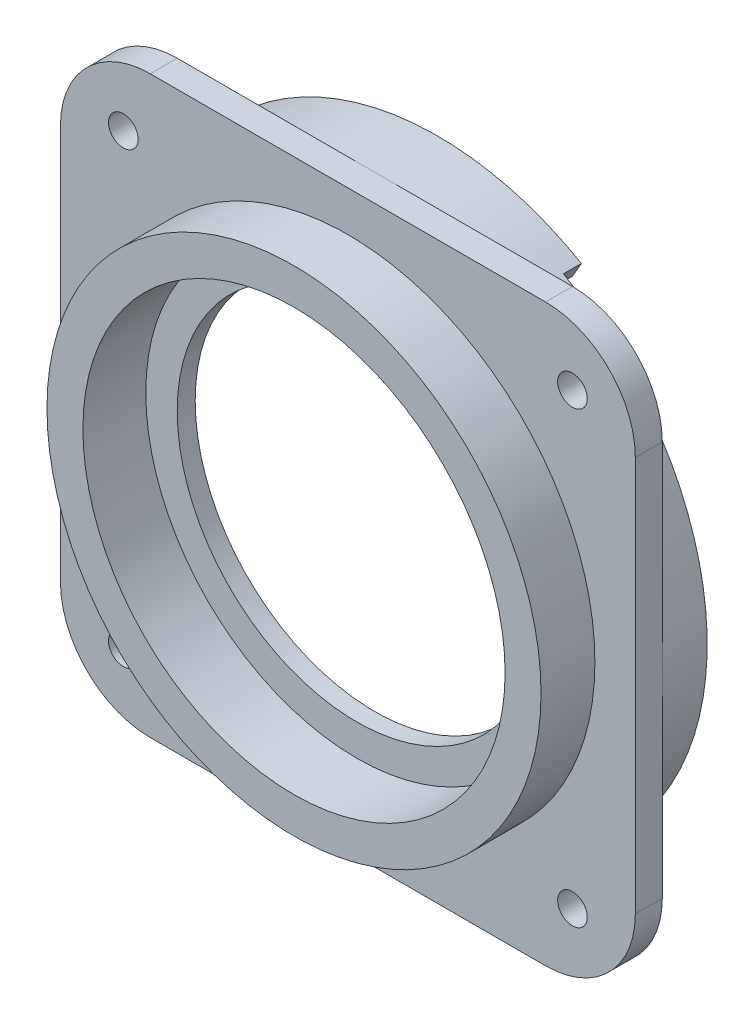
ISO-10303-21;
HEADER;
FILE_DESCRIPTION(('STEP AP214'),'2;1');
FILE_NAME('part.step','',(''),(''),'','','');
FILE_SCHEMA(('AUTOMOTIVE_DESIGN { 1 0 10303 214 1 1 1 1 }'));
ENDSEC;
DATA;
#1=APPLICATION_CONTEXT('core data for automotive mechanical design processes');
#2=APPLICATION_PROTOCOL_DEFINITION('international standard','automotive_design',2000,#1);
#3=PRODUCT_CONTEXT('',#1,'mechanical');
#4=PRODUCT('Part','Part','',(#3));
#5=PRODUCT_RELATED_PRODUCT_CATEGORY('part','',(#4));
#6=PRODUCT_DEFINITION_FORMATION('','',#4);
#7=PRODUCT_DEFINITION_CONTEXT('part definition',#1,'design');
#8=PRODUCT_DEFINITION('design','',#6,#7);
#9=PRODUCT_DEFINITION_SHAPE('','',#8);
#10=(LENGTH_UNIT() NAMED_UNIT(*) SI_UNIT(.MILLI.,.METRE.));
#11=(NAMED_UNIT(*) PLANE_ANGLE_UNIT() SI_UNIT($,.RADIAN.));
#12=(NAMED_UNIT(*) SI_UNIT($,.STERADIAN.) SOLID_ANGLE_UNIT());
#13=UNCERTAINTY_MEASURE_WITH_UNIT(LENGTH_MEASURE(1.E-05),#10,'distance_accuracy_value','');
#14=(GEOMETRIC_REPRESENTATION_CONTEXT(3) GLOBAL_UNCERTAINTY_ASSIGNED_CONTEXT((#13)) GLOBAL_UNIT_ASSIGNED_CONTEXT((#10,
#11,#12)) REPRESENTATION_CONTEXT('',''));
#15=CARTESIAN_POINT('',(0.,0.,0.));
#16=DIRECTION('',(0.,0.,1.));
#17=DIRECTION('',(1.,0.,0.));
#18=AXIS2_PLACEMENT_3D('',#15,#16,#17);
#19=CARTESIAN_POINT('',(0.,0.,10.));
#20=DIRECTION('',(0.,0.,1.));
#21=DIRECTION('',(1.,0.,0.));
#22=AXIS2_PLACEMENT_3D('',#19,#20,#21);
#23=PLANE('',#22);
#24=CARTESIAN_POINT('',(0.,0.,10.));
#25=DIRECTION('',(0.,0.,1.));
#26=DIRECTION('',(1.,0.,0.));
#27=AXIS2_PLACEMENT_3D('',#24,#25,#26);
#28=CIRCLE('',#27,23.5);
#29=CARTESIAN_POINT('',(23.5,0.,10.));
#30=VERTEX_POINT('',#29);
#31=EDGE_CURVE('E205',#30,#30,#28,.T.);
#32=ORIENTED_EDGE('',*,*,#31,.F.);
#33=EDGE_LOOP('',(#32));
#34=FACE_BOUND('',#33,.T.);
#35=CARTESIAN_POINT('',(0.,0.,10.));
#36=DIRECTION('',(0.,0.,1.));
#37=DIRECTION('',(1.,0.,0.));
#38=AXIS2_PLACEMENT_3D('',#35,#36,#37);
#39=CIRCLE('',#38,27.5);
#40=CARTESIAN_POINT('',(27.5,0.,10.));
#41=VERTEX_POINT('',#40);
#42=EDGE_CURVE('E448',#41,#41,#39,.T.);
#43=ORIENTED_EDGE('',*,*,#42,.T.);
#44=EDGE_LOOP('',(#43));
#45=FACE_BOUND('',#44,.T.);
#46=ADVANCED_FACE('F74',(#34,#45),#23,.T.);
#47=CARTESIAN_POINT('',(0.,0.,4.));
#48=DIRECTION('',(0.,0.,1.));
#49=DIRECTION('',(1.,0.,0.));
#50=AXIS2_PLACEMENT_3D('',#47,#48,#49);
#51=CYLINDRICAL_SURFACE('',#50,20.);
#52=CARTESIAN_POINT('',(0.,0.,1.));
#53=DIRECTION('',(0.,0.,-1.));
#54=DIRECTION('',(-1.,0.,0.));
#55=AXIS2_PLACEMENT_3D('',#52,#53,#54);
#56=CIRCLE('',#55,20.);
#57=CARTESIAN_POINT('',(-20.,0.,1.));
#58=VERTEX_POINT('',#57);
#59=EDGE_CURVE('E212',#58,#58,#56,.T.);
#60=ORIENTED_EDGE('',*,*,#59,.T.);
#61=EDGE_LOOP('',(#60));
#62=FACE_BOUND('',#61,.T.);
#63=CARTESIAN_POINT('',(0.,0.,3.));
#64=DIRECTION('',(0.,0.,1.));
#65=DIRECTION('',(1.,0.,0.));
#66=AXIS2_PLACEMENT_3D('',#63,#64,#65);
#67=CIRCLE('',#66,20.);
#68=CARTESIAN_POINT('',(20.,0.,3.));
#69=VERTEX_POINT('',#68);
#70=EDGE_CURVE('E78',#69,#69,#67,.F.);
#71=ORIENTED_EDGE('',*,*,#70,.F.);
#72=EDGE_LOOP('',(#71));
#73=FACE_BOUND('',#72,.T.);
#74=ADVANCED_FACE('F381',(#62,#73),#51,.F.);
#75=CARTESIAN_POINT('',(0.,0.,6.));
#76=DIRECTION('',(0.,0.,-1.));
#77=DIRECTION('',(-1.,0.,0.));
#78=AXIS2_PLACEMENT_3D('',#75,#76,#77);
#79=CYLINDRICAL_SURFACE('',#78,32.);
#80=CARTESIAN_POINT('',(0.,0.,-6.));
#81=DIRECTION('',(0.,0.,1.));
#82=DIRECTION('',(1.,0.,0.));
#83=AXIS2_PLACEMENT_3D('',#80,#81,#82);
#84=CIRCLE('',#83,32.);
#85=CARTESIAN_POINT('',(16.0000000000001,27.712812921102,-6.));
#86=VERTEX_POINT('',#85);
#87=CARTESIAN_POINT('',(16.0000000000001,-27.712812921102,-6.));
#88=VERTEX_POINT('',#87);
#89=EDGE_CURVE('E273',#86,#88,#84,.T.);
#90=ORIENTED_EDGE('',*,*,#89,.T.);
#91=DIRECTION('',(0.,0.,-1.));
#92=VECTOR('',#91,1.);
#93=CARTESIAN_POINT('',(16.0000000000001,-27.712812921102,-4.));
#94=LINE('',#93,#92);
#95=CARTESIAN_POINT('',(16.0000000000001,-27.712812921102,-4.));
#96=VERTEX_POINT('',#95);
#97=EDGE_CURVE('E200',#96,#88,#94,.T.);
#98=ORIENTED_EDGE('',*,*,#97,.F.);
#99=CARTESIAN_POINT('',(0.,0.,-4.));
#100=DIRECTION('',(0.,0.,-1.));
#101=DIRECTION('',(-1.,0.,0.));
#102=AXIS2_PLACEMENT_3D('',#99,#100,#101);
#103=CIRCLE('',#102,32.);
#104=CARTESIAN_POINT('',(16.0000000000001,27.712812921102,-4.));
#105=VERTEX_POINT('',#104);
#106=EDGE_CURVE('E182',#105,#96,#103,.T.);
#107=ORIENTED_EDGE('',*,*,#106,.F.);
#108=DIRECTION('',(0.,0.,-1.));
#109=VECTOR('',#108,1.);
#110=CARTESIAN_POINT('',(16.0000000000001,27.712812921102,-4.));
#111=LINE('',#110,#109);
#112=EDGE_CURVE('E179',#105,#86,#111,.T.);
#113=ORIENTED_EDGE('',*,*,#112,.T.);
#114=EDGE_LOOP('',(#90,#98,#107,#113));
#115=FACE_BOUND('',#114,.T.);
#116=CARTESIAN_POINT('',(0.,0.,1.));
#117=DIRECTION('',(0.,0.,-1.));
#118=DIRECTION('',(-1.,0.,0.));
#119=AXIS2_PLACEMENT_3D('',#116,#117,#118);
#120=CIRCLE('',#119,32.);
#121=CARTESIAN_POINT('',(32.,0.,1.));
#122=VERTEX_POINT('',#121);
#123=CARTESIAN_POINT('',(0.,-32.,1.));
#124=VERTEX_POINT('',#123);
#125=EDGE_CURVE('E269',#122,#124,#120,.T.);
#126=ORIENTED_EDGE('',*,*,#125,.T.);
#127=CARTESIAN_POINT('',(0.,0.,1.));
#128=DIRECTION('',(0.,0.,-1.));
#129=DIRECTION('',(-1.,0.,0.));
#130=AXIS2_PLACEMENT_3D('',#127,#128,#129);
#131=CIRCLE('',#130,32.);
#132=CARTESIAN_POINT('',(-32.,0.,1.));
#133=VERTEX_POINT('',#132);
#134=EDGE_CURVE('E233',#124,#133,#131,.T.);
#135=ORIENTED_EDGE('',*,*,#134,.T.);
#136=CARTESIAN_POINT('',(0.,0.,1.));
#137=DIRECTION('',(0.,0.,-1.));
#138=DIRECTION('',(-1.,0.,0.));
#139=AXIS2_PLACEMENT_3D('',#136,#137,#138);
#140=CIRCLE('',#139,32.);
#141=CARTESIAN_POINT('',(0.,32.,1.));
#142=VERTEX_POINT('',#141);
#143=EDGE_CURVE('E239',#133,#142,#140,.T.);
#144=ORIENTED_EDGE('',*,*,#143,.T.);
#145=CARTESIAN_POINT('',(0.,0.,1.));
#146=DIRECTION('',(0.,0.,-1.));
#147=DIRECTION('',(-1.,0.,0.));
#148=AXIS2_PLACEMENT_3D('',#145,#146,#147);
#149=CIRCLE('',#148,32.);
#150=EDGE_CURVE('E255',#142,#122,#149,.T.);
#151=ORIENTED_EDGE('',*,*,#150,.T.);
#152=EDGE_LOOP('',(#126,#135,#144,#151));
#153=FACE_BOUND('',#152,.T.);
#154=ADVANCED_FACE('F346',(#115,#153),#79,.T.);
#155=CARTESIAN_POINT('',(0.,0.,6.));
#156=DIRECTION('',(0.,0.,-1.));
#157=DIRECTION('',(-1.,0.,0.));
#158=AXIS2_PLACEMENT_3D('',#155,#156,#157);
#159=CYLINDRICAL_SURFACE('',#158,30.);
#160=DIRECTION('',(0.,0.,-1.));
#161=VECTOR('',#160,1.);
#162=CARTESIAN_POINT('',(15.0000000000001,-25.9807621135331,-4.));
#163=LINE('',#162,#161);
#164=CARTESIAN_POINT('',(15.0000000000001,-25.9807621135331,-4.));
#165=VERTEX_POINT('',#164);
#166=CARTESIAN_POINT('',(15.0000000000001,-25.9807621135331,-6.));
#167=VERTEX_POINT('',#166);
#168=EDGE_CURVE('E209',#165,#167,#163,.T.);
#169=ORIENTED_EDGE('',*,*,#168,.T.);
#170=CARTESIAN_POINT('',(0.,0.,-6.));
#171=DIRECTION('',(0.,0.,1.));
#172=DIRECTION('',(1.,0.,0.));
#173=AXIS2_PLACEMENT_3D('',#170,#171,#172);
#174=CIRCLE('',#173,30.);
#175=CARTESIAN_POINT('',(15.0000000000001,25.9807621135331,-6.));
#176=VERTEX_POINT('',#175);
#177=EDGE_CURVE('E198',#176,#167,#174,.T.);
#178=ORIENTED_EDGE('',*,*,#177,.F.);
#179=DIRECTION('',(0.,0.,-1.));
#180=VECTOR('',#179,1.);
#181=CARTESIAN_POINT('',(15.0000000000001,25.9807621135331,-4.));
#182=LINE('',#181,#180);
#183=CARTESIAN_POINT('',(15.0000000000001,25.9807621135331,-4.));
#184=VERTEX_POINT('',#183);
#185=EDGE_CURVE('E90',#184,#176,#182,.T.);
#186=ORIENTED_EDGE('',*,*,#185,.F.);
#187=CARTESIAN_POINT('',(0.,0.,-4.));
#188=DIRECTION('',(0.,0.,1.));
#189=DIRECTION('',(-1.,0.,0.));
#190=AXIS2_PLACEMENT_3D('',#187,#188,#189);
#191=CIRCLE('',#190,30.);
#192=EDGE_CURVE('E183',#165,#184,#191,.T.);
#193=ORIENTED_EDGE('',*,*,#192,.F.);
#194=EDGE_LOOP('',(#169,#178,#186,#193));
#195=FACE_BOUND('',#194,.T.);
#196=CARTESIAN_POINT('',(0.,0.,1.));
#197=DIRECTION('',(0.,0.,-1.));
#198=DIRECTION('',(-1.,0.,0.));
#199=AXIS2_PLACEMENT_3D('',#196,#197,#198);
#200=CIRCLE('',#199,30.);
#201=CARTESIAN_POINT('',(-30.,0.,1.));
#202=VERTEX_POINT('',#201);
#203=EDGE_CURVE('E12',#202,#202,#200,.T.);
#204=ORIENTED_EDGE('',*,*,#203,.F.);
#205=EDGE_LOOP('',(#204));
#206=FACE_BOUND('',#205,.T.);
#207=ADVANCED_FACE('F195',(#195,#206),#159,.F.);
#208=CARTESIAN_POINT('',(0.,0.,-6.));
#209=DIRECTION('',(0.,0.,1.));
#210=DIRECTION('',(1.,0.,0.));
#211=AXIS2_PLACEMENT_3D('',#208,#209,#210);
#212=PLANE('',#211);
#213=ORIENTED_EDGE('',*,*,#177,.T.);
#214=DIRECTION('',(-0.500000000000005,0.866025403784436,0.));
#215=VECTOR('',#214,1.);
#216=CARTESIAN_POINT('',(16.0000000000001,-27.712812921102,-6.));
#217=LINE('',#216,#215);
#218=EDGE_CURVE('E192',#88,#167,#217,.T.);
#219=ORIENTED_EDGE('',*,*,#218,.F.);
#220=ORIENTED_EDGE('',*,*,#89,.F.);
#221=DIRECTION('',(0.500000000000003,0.866025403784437,0.));
#222=VECTOR('',#221,1.);
#223=CARTESIAN_POINT('',(16.0000000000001,27.712812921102,-6.));
#224=LINE('',#223,#222);
#225=EDGE_CURVE('E447',#176,#86,#224,.T.);
#226=ORIENTED_EDGE('',*,*,#225,.F.);
#227=EDGE_LOOP('',(#213,#219,#220,#226));
#228=FACE_BOUND('',#227,.T.);
#229=ADVANCED_FACE('F462',(#228),#212,.F.);
#230=CARTESIAN_POINT('',(32.,0.,4.));
#231=DIRECTION('',(-1.,0.,0.));
#232=DIRECTION('',(0.,0.,1.));
#233=AXIS2_PLACEMENT_3D('',#230,#231,#232);
#234=PLANE('',#233);
#235=DIRECTION('',(0.,1.,0.));
#236=VECTOR('',#235,1.);
#237=CARTESIAN_POINT('',(32.,0.,4.));
#238=LINE('',#237,#236);
#239=CARTESIAN_POINT('',(32.,-22.,4.));
#240=VERTEX_POINT('',#239);
#241=CARTESIAN_POINT('',(32.,22.,4.));
#242=VERTEX_POINT('',#241);
#243=EDGE_CURVE('E261',#240,#242,#238,.T.);
#244=ORIENTED_EDGE('',*,*,#243,.F.);
#245=DIRECTION('',(0.,0.,-1.));
#246=VECTOR('',#245,1.);
#247=CARTESIAN_POINT('',(32.,-22.,1.));
#248=LINE('',#247,#246);
#249=CARTESIAN_POINT('',(32.,-22.,1.));
#250=VERTEX_POINT('',#249);
#251=EDGE_CURVE('E303',#240,#250,#248,.T.);
#252=ORIENTED_EDGE('',*,*,#251,.T.);
#253=DIRECTION('',(0.,1.,0.));
#254=VECTOR('',#253,1.);
#255=CARTESIAN_POINT('',(32.,0.,1.));
#256=LINE('',#255,#254);
#257=EDGE_CURVE('E265',#250,#122,#256,.T.);
#258=ORIENTED_EDGE('',*,*,#257,.T.);
#259=DIRECTION('',(0.,1.,0.));
#260=VECTOR('',#259,1.);
#261=CARTESIAN_POINT('',(32.,0.,1.));
#262=LINE('',#261,#260);
#263=CARTESIAN_POINT('',(32.,22.,1.));
#264=VERTEX_POINT('',#263);
#265=EDGE_CURVE('E258',#122,#264,#262,.T.);
#266=ORIENTED_EDGE('',*,*,#265,.T.);
#267=DIRECTION('',(0.,0.,-1.));
#268=VECTOR('',#267,1.);
#269=CARTESIAN_POINT('',(32.,22.,4.));
#270=LINE('',#269,#268);
#271=EDGE_CURVE('E301',#264,#242,#270,.F.);
#272=ORIENTED_EDGE('',*,*,#271,.T.);
#273=EDGE_LOOP('',(#244,#252,#258,#266,#272));
#274=FACE_BOUND('',#273,.T.);
#275=ADVANCED_FACE('F365',(#274),#234,.F.);
#276=CARTESIAN_POINT('',(0.,-32.,4.));
#277=DIRECTION('',(0.,-1.,0.));
#278=DIRECTION('',(0.,0.,-1.));
#279=AXIS2_PLACEMENT_3D('',#276,#277,#278);
#280=PLANE('',#279);
#281=DIRECTION('',(-1.,0.,0.));
#282=VECTOR('',#281,1.);
#283=CARTESIAN_POINT('',(0.,-32.,4.));
#284=LINE('',#283,#282);
#285=CARTESIAN_POINT('',(22.,-32.,4.));
#286=VERTEX_POINT('',#285);
#287=CARTESIAN_POINT('',(-22.,-32.,4.));
#288=VERTEX_POINT('',#287);
#289=EDGE_CURVE('E230',#286,#288,#284,.T.);
#290=ORIENTED_EDGE('',*,*,#289,.T.);
#291=DIRECTION('',(0.,0.,-1.));
#292=VECTOR('',#291,1.);
#293=CARTESIAN_POINT('',(-22.,-32.,4.));
#294=LINE('',#293,#292);
#295=CARTESIAN_POINT('',(-22.,-32.,1.));
#296=VERTEX_POINT('',#295);
#297=EDGE_CURVE('E288',#288,#296,#294,.T.);
#298=ORIENTED_EDGE('',*,*,#297,.T.);
#299=DIRECTION('',(-1.,0.,0.));
#300=VECTOR('',#299,1.);
#301=CARTESIAN_POINT('',(0.,-32.,1.));
#302=LINE('',#301,#300);
#303=EDGE_CURVE('E234',#124,#296,#302,.T.);
#304=ORIENTED_EDGE('',*,*,#303,.F.);
#305=DIRECTION('',(-1.,0.,0.));
#306=VECTOR('',#305,1.);
#307=CARTESIAN_POINT('',(0.,-32.,1.));
#308=LINE('',#307,#306);
#309=CARTESIAN_POINT('',(22.,-32.,1.));
#310=VERTEX_POINT('',#309);
#311=EDGE_CURVE('E267',#310,#124,#308,.T.);
#312=ORIENTED_EDGE('',*,*,#311,.F.);
#313=DIRECTION('',(0.,0.,-1.));
#314=VECTOR('',#313,1.);
#315=CARTESIAN_POINT('',(22.,-32.,4.));
#316=LINE('',#315,#314);
#317=EDGE_CURVE('E276',#310,#286,#316,.F.);
#318=ORIENTED_EDGE('',*,*,#317,.T.);
#319=EDGE_LOOP('',(#290,#298,#304,#312,#318));
#320=FACE_BOUND('',#319,.T.);
#321=ADVANCED_FACE('F354',(#320),#280,.T.);
#322=CARTESIAN_POINT('',(0.,0.,4.));
#323=DIRECTION('',(0.,0.,-1.));
#324=DIRECTION('',(-1.,0.,0.));
#325=AXIS2_PLACEMENT_3D('',#322,#323,#324);
#326=PLANE('',#325);
#327=CARTESIAN_POINT('',(25.,-25.,4.));
#328=DIRECTION('',(0.,0.,1.));
#329=DIRECTION('',(1.,0.,0.));
#330=AXIS2_PLACEMENT_3D('',#327,#328,#329);
#331=CIRCLE('',#330,1.65);
#332=CARTESIAN_POINT('',(26.65,-25.,4.));
#333=VERTEX_POINT('',#332);
#334=EDGE_CURVE('E220',#333,#333,#331,.T.);
#335=ORIENTED_EDGE('',*,*,#334,.F.);
#336=EDGE_LOOP('',(#335));
#337=FACE_BOUND('',#336,.T.);
#338=ORIENTED_EDGE('',*,*,#289,.F.);
#339=CARTESIAN_POINT('',(22.,-22.,4.));
#340=DIRECTION('',(0.,0.,-1.));
#341=DIRECTION('',(-1.,0.,0.));
#342=AXIS2_PLACEMENT_3D('',#339,#340,#341);
#343=CIRCLE('',#342,10.);
#344=EDGE_CURVE('E308',#286,#240,#343,.F.);
#345=ORIENTED_EDGE('',*,*,#344,.T.);
#346=ORIENTED_EDGE('',*,*,#243,.T.);
#347=CARTESIAN_POINT('',(22.,22.,4.));
#348=DIRECTION('',(0.,0.,-1.));
#349=DIRECTION('',(-1.,0.,0.));
#350=AXIS2_PLACEMENT_3D('',#347,#348,#349);
#351=CIRCLE('',#350,10.);
#352=CARTESIAN_POINT('',(22.,32.,4.));
#353=VERTEX_POINT('',#352);
#354=EDGE_CURVE('E317',#242,#353,#351,.F.);
#355=ORIENTED_EDGE('',*,*,#354,.T.);
#356=DIRECTION('',(-1.,0.,0.));
#357=VECTOR('',#356,1.);
#358=CARTESIAN_POINT('',(0.,32.,4.));
#359=LINE('',#358,#357);
#360=CARTESIAN_POINT('',(-22.,32.,4.));
#361=VERTEX_POINT('',#360);
#362=EDGE_CURVE('E98',#353,#361,#359,.T.);
#363=ORIENTED_EDGE('',*,*,#362,.T.);
#364=CARTESIAN_POINT('',(-22.,22.,4.));
#365=DIRECTION('',(0.,0.,-1.));
#366=DIRECTION('',(-1.,0.,0.));
#367=AXIS2_PLACEMENT_3D('',#364,#365,#366);
#368=CIRCLE('',#367,10.);
#369=CARTESIAN_POINT('',(-32.,22.,4.));
#370=VERTEX_POINT('',#369);
#371=EDGE_CURVE('E83',#361,#370,#368,.F.);
#372=ORIENTED_EDGE('',*,*,#371,.T.);
#373=DIRECTION('',(0.,1.,0.));
#374=VECTOR('',#373,1.);
#375=CARTESIAN_POINT('',(-32.,0.,4.));
#376=LINE('',#375,#374);
#377=CARTESIAN_POINT('',(-32.,-22.,4.));
#378=VERTEX_POINT('',#377);
#379=EDGE_CURVE('E245',#378,#370,#376,.T.);
#380=ORIENTED_EDGE('',*,*,#379,.F.);
#381=CARTESIAN_POINT('',(-22.,-22.,4.));
#382=DIRECTION('',(0.,0.,-1.));
#383=DIRECTION('',(-1.,0.,0.));
#384=AXIS2_PLACEMENT_3D('',#381,#382,#383);
#385=CIRCLE('',#384,10.);
#386=EDGE_CURVE('E299',#378,#288,#385,.F.);
#387=ORIENTED_EDGE('',*,*,#386,.T.);
#388=EDGE_LOOP('',(#338,#345,#346,#355,#363,#372,#380,#387));
#389=FACE_BOUND('',#388,.T.);
#390=CARTESIAN_POINT('',(25.,25.,4.));
#391=DIRECTION('',(0.,0.,1.));
#392=DIRECTION('',(1.,0.,0.));
#393=AXIS2_PLACEMENT_3D('',#390,#391,#392);
#394=CIRCLE('',#393,1.65);
#395=CARTESIAN_POINT('',(26.65,25.,4.));
#396=VERTEX_POINT('',#395);
#397=EDGE_CURVE('E216',#396,#396,#394,.T.);
#398=ORIENTED_EDGE('',*,*,#397,.F.);
#399=EDGE_LOOP('',(#398));
#400=FACE_BOUND('',#399,.T.);
#401=CARTESIAN_POINT('',(-25.,25.,4.));
#402=DIRECTION('',(0.,0.,1.));
#403=DIRECTION('',(1.,0.,0.));
#404=AXIS2_PLACEMENT_3D('',#401,#402,#403);
#405=CIRCLE('',#404,1.65);
#406=CARTESIAN_POINT('',(-23.35,25.,4.));
#407=VERTEX_POINT('',#406);
#408=EDGE_CURVE('E225',#407,#407,#405,.T.);
#409=ORIENTED_EDGE('',*,*,#408,.F.);
#410=EDGE_LOOP('',(#409));
#411=FACE_BOUND('',#410,.T.);
#412=CARTESIAN_POINT('',(-25.,-25.,4.));
#413=DIRECTION('',(0.,0.,1.));
#414=DIRECTION('',(1.,0.,0.));
#415=AXIS2_PLACEMENT_3D('',#412,#413,#414);
#416=CIRCLE('',#415,1.65);
#417=CARTESIAN_POINT('',(-23.35,-25.,4.));
#418=VERTEX_POINT('',#417);
#419=EDGE_CURVE('E215',#418,#418,#416,.T.);
#420=ORIENTED_EDGE('',*,*,#419,.F.);
#421=EDGE_LOOP('',(#420));
#422=FACE_BOUND('',#421,.T.);
#423=CARTESIAN_POINT('',(0.,0.,4.));
#424=DIRECTION('',(0.,0.,-1.));
#425=DIRECTION('',(-1.,0.,0.));
#426=AXIS2_PLACEMENT_3D('',#423,#424,#425);
#427=CIRCLE('',#426,27.5);
#428=CARTESIAN_POINT('',(-27.5,0.,4.));
#429=VERTEX_POINT('',#428);
#430=EDGE_CURVE('E445',#429,#429,#427,.F.);
#431=ORIENTED_EDGE('',*,*,#430,.F.);
#432=EDGE_LOOP('',(#431));
#433=FACE_BOUND('',#432,.T.);
#434=ADVANCED_FACE('F323',(#337,#389,#400,#411,#422,#433),#326,.F.);
#435=CARTESIAN_POINT('',(0.,0.,1.));
#436=DIRECTION('',(0.,0.,-1.));
#437=DIRECTION('',(-1.,0.,0.));
#438=AXIS2_PLACEMENT_3D('',#435,#436,#437);
#439=PLANE('',#438);
#440=CARTESIAN_POINT('',(25.,-25.,1.));
#441=DIRECTION('',(0.,0.,-1.));
#442=DIRECTION('',(-1.,0.,0.));
#443=AXIS2_PLACEMENT_3D('',#440,#441,#442);
#444=CIRCLE('',#443,1.65);
#445=CARTESIAN_POINT('',(23.35,-25.,1.));
#446=VERTEX_POINT('',#445);
#447=EDGE_CURVE('E229',#446,#446,#444,.T.);
#448=ORIENTED_EDGE('',*,*,#447,.F.);
#449=EDGE_LOOP('',(#448));
#450=FACE_BOUND('',#449,.T.);
#451=ORIENTED_EDGE('',*,*,#257,.F.);
#452=CARTESIAN_POINT('',(22.,-22.,1.));
#453=DIRECTION('',(0.,0.,-1.));
#454=DIRECTION('',(-1.,0.,0.));
#455=AXIS2_PLACEMENT_3D('',#452,#453,#454);
#456=CIRCLE('',#455,10.);
#457=EDGE_CURVE('E306',#250,#310,#456,.T.);
#458=ORIENTED_EDGE('',*,*,#457,.T.);
#459=ORIENTED_EDGE('',*,*,#311,.T.);
#460=ORIENTED_EDGE('',*,*,#125,.F.);
#461=EDGE_LOOP('',(#451,#458,#459,#460));
#462=FACE_BOUND('',#461,.T.);
#463=ADVANCED_FACE('F367',(#450,#462),#439,.T.);
#464=CARTESIAN_POINT('',(0.,32.,4.));
#465=DIRECTION('',(0.,-1.,0.));
#466=DIRECTION('',(0.,0.,-1.));
#467=AXIS2_PLACEMENT_3D('',#464,#465,#466);
#468=PLANE('',#467);
#469=ORIENTED_EDGE('',*,*,#362,.F.);
#470=DIRECTION('',(0.,0.,-1.));
#471=VECTOR('',#470,1.);
#472=CARTESIAN_POINT('',(22.,32.,4.));
#473=LINE('',#472,#471);
#474=CARTESIAN_POINT('',(22.,32.,1.));
#475=VERTEX_POINT('',#474);
#476=EDGE_CURVE('E313',#353,#475,#473,.T.);
#477=ORIENTED_EDGE('',*,*,#476,.T.);
#478=DIRECTION('',(-1.,0.,0.));
#479=VECTOR('',#478,1.);
#480=CARTESIAN_POINT('',(0.,32.,1.));
#481=LINE('',#480,#479);
#482=EDGE_CURVE('E249',#475,#142,#481,.T.);
#483=ORIENTED_EDGE('',*,*,#482,.T.);
#484=DIRECTION('',(-1.,0.,0.));
#485=VECTOR('',#484,1.);
#486=CARTESIAN_POINT('',(0.,32.,1.));
#487=LINE('',#486,#485);
#488=CARTESIAN_POINT('',(-22.,32.,1.));
#489=VERTEX_POINT('',#488);
#490=EDGE_CURVE('E242',#142,#489,#487,.T.);
#491=ORIENTED_EDGE('',*,*,#490,.T.);
#492=DIRECTION('',(0.,0.,-1.));
#493=VECTOR('',#492,1.);
#494=CARTESIAN_POINT('',(-22.,32.,4.));
#495=LINE('',#494,#493);
#496=EDGE_CURVE('E311',#489,#361,#495,.F.);
#497=ORIENTED_EDGE('',*,*,#496,.T.);
#498=EDGE_LOOP('',(#469,#477,#483,#491,#497));
#499=FACE_BOUND('',#498,.T.);
#500=ADVANCED_FACE('F338',(#499),#468,.F.);
#501=CARTESIAN_POINT('',(0.,0.,1.));
#502=DIRECTION('',(0.,0.,-1.));
#503=DIRECTION('',(-1.,0.,0.));
#504=AXIS2_PLACEMENT_3D('',#501,#502,#503);
#505=PLANE('',#504);
#506=CARTESIAN_POINT('',(25.,25.,1.));
#507=DIRECTION('',(0.,0.,-1.));
#508=DIRECTION('',(-1.,0.,0.));
#509=AXIS2_PLACEMENT_3D('',#506,#507,#508);
#510=CIRCLE('',#509,1.65);
#511=CARTESIAN_POINT('',(23.35,25.,1.));
#512=VERTEX_POINT('',#511);
#513=EDGE_CURVE('E281',#512,#512,#510,.T.);
#514=ORIENTED_EDGE('',*,*,#513,.F.);
#515=EDGE_LOOP('',(#514));
#516=FACE_BOUND('',#515,.T.);
#517=ORIENTED_EDGE('',*,*,#482,.F.);
#518=CARTESIAN_POINT('',(22.,22.,1.));
#519=DIRECTION('',(0.,0.,-1.));
#520=DIRECTION('',(-1.,0.,0.));
#521=AXIS2_PLACEMENT_3D('',#518,#519,#520);
#522=CIRCLE('',#521,10.);
#523=EDGE_CURVE('E315',#475,#264,#522,.T.);
#524=ORIENTED_EDGE('',*,*,#523,.T.);
#525=ORIENTED_EDGE('',*,*,#265,.F.);
#526=ORIENTED_EDGE('',*,*,#150,.F.);
#527=EDGE_LOOP('',(#517,#524,#525,#526));
#528=FACE_BOUND('',#527,.T.);
#529=ADVANCED_FACE('F344',(#516,#528),#505,.T.);
#530=CARTESIAN_POINT('',(-32.,0.,4.));
#531=DIRECTION('',(-1.,0.,0.));
#532=DIRECTION('',(0.,0.,1.));
#533=AXIS2_PLACEMENT_3D('',#530,#531,#532);
#534=PLANE('',#533);
#535=DIRECTION('',(0.,1.,0.));
#536=VECTOR('',#535,1.);
#537=CARTESIAN_POINT('',(-32.,0.,1.));
#538=LINE('',#537,#536);
#539=CARTESIAN_POINT('',(-32.,-22.,1.));
#540=VERTEX_POINT('',#539);
#541=EDGE_CURVE('E237',#540,#133,#538,.T.);
#542=ORIENTED_EDGE('',*,*,#541,.F.);
#543=DIRECTION('',(0.,0.,-1.));
#544=VECTOR('',#543,1.);
#545=CARTESIAN_POINT('',(-32.,-22.,4.));
#546=LINE('',#545,#544);
#547=EDGE_CURVE('E296',#540,#378,#546,.F.);
#548=ORIENTED_EDGE('',*,*,#547,.T.);
#549=ORIENTED_EDGE('',*,*,#379,.T.);
#550=DIRECTION('',(0.,0.,-1.));
#551=VECTOR('',#550,1.);
#552=CARTESIAN_POINT('',(-32.,22.,1.));
#553=LINE('',#552,#551);
#554=CARTESIAN_POINT('',(-32.,22.,1.));
#555=VERTEX_POINT('',#554);
#556=EDGE_CURVE('E293',#370,#555,#553,.T.);
#557=ORIENTED_EDGE('',*,*,#556,.T.);
#558=DIRECTION('',(0.,1.,0.));
#559=VECTOR('',#558,1.);
#560=CARTESIAN_POINT('',(-32.,0.,1.));
#561=LINE('',#560,#559);
#562=EDGE_CURVE('E246',#133,#555,#561,.T.);
#563=ORIENTED_EDGE('',*,*,#562,.F.);
#564=EDGE_LOOP('',(#542,#548,#549,#557,#563));
#565=FACE_BOUND('',#564,.T.);
#566=ADVANCED_FACE('F330',(#565),#534,.T.);
#567=CARTESIAN_POINT('',(0.,0.,1.));
#568=DIRECTION('',(0.,0.,-1.));
#569=DIRECTION('',(-1.,0.,0.));
#570=AXIS2_PLACEMENT_3D('',#567,#568,#569);
#571=PLANE('',#570);
#572=CARTESIAN_POINT('',(-25.,25.,1.));
#573=DIRECTION('',(0.,0.,-1.));
#574=DIRECTION('',(-1.,0.,0.));
#575=AXIS2_PLACEMENT_3D('',#572,#573,#574);
#576=CIRCLE('',#575,1.65);
#577=CARTESIAN_POINT('',(-26.65,25.,1.));
#578=VERTEX_POINT('',#577);
#579=EDGE_CURVE('E228',#578,#578,#576,.T.);
#580=ORIENTED_EDGE('',*,*,#579,.F.);
#581=EDGE_LOOP('',(#580));
#582=FACE_BOUND('',#581,.T.);
#583=ORIENTED_EDGE('',*,*,#562,.T.);
#584=CARTESIAN_POINT('',(-22.,22.,1.));
#585=DIRECTION('',(0.,0.,-1.));
#586=DIRECTION('',(-1.,0.,0.));
#587=AXIS2_PLACEMENT_3D('',#584,#585,#586);
#588=CIRCLE('',#587,10.);
#589=EDGE_CURVE('E319',#555,#489,#588,.T.);
#590=ORIENTED_EDGE('',*,*,#589,.T.);
#591=ORIENTED_EDGE('',*,*,#490,.F.);
#592=ORIENTED_EDGE('',*,*,#143,.F.);
#593=EDGE_LOOP('',(#583,#590,#591,#592));
#594=FACE_BOUND('',#593,.T.);
#595=ADVANCED_FACE('F336',(#582,#594),#571,.T.);
#596=CARTESIAN_POINT('',(0.,0.,1.));
#597=DIRECTION('',(0.,0.,-1.));
#598=DIRECTION('',(-1.,0.,0.));
#599=AXIS2_PLACEMENT_3D('',#596,#597,#598);
#600=PLANE('',#599);
#601=CARTESIAN_POINT('',(-25.,-25.,1.));
#602=DIRECTION('',(0.,0.,-1.));
#603=DIRECTION('',(-1.,0.,0.));
#604=AXIS2_PLACEMENT_3D('',#601,#602,#603);
#605=CIRCLE('',#604,1.65);
#606=CARTESIAN_POINT('',(-26.65,-25.,1.));
#607=VERTEX_POINT('',#606);
#608=EDGE_CURVE('E219',#607,#607,#605,.T.);
#609=ORIENTED_EDGE('',*,*,#608,.F.);
#610=EDGE_LOOP('',(#609));
#611=FACE_BOUND('',#610,.T.);
#612=ORIENTED_EDGE('',*,*,#303,.T.);
#613=CARTESIAN_POINT('',(-22.,-22.,1.));
#614=DIRECTION('',(0.,0.,-1.));
#615=DIRECTION('',(-1.,0.,0.));
#616=AXIS2_PLACEMENT_3D('',#613,#614,#615);
#617=CIRCLE('',#616,10.);
#618=EDGE_CURVE('E291',#296,#540,#617,.T.);
#619=ORIENTED_EDGE('',*,*,#618,.T.);
#620=ORIENTED_EDGE('',*,*,#541,.T.);
#621=ORIENTED_EDGE('',*,*,#134,.F.);
#622=EDGE_LOOP('',(#612,#619,#620,#621));
#623=FACE_BOUND('',#622,.T.);
#624=ADVANCED_FACE('F351',(#611,#623),#600,.T.);
#625=CARTESIAN_POINT('',(-25.,25.,-6.));
#626=DIRECTION('',(0.,0.,1.));
#627=DIRECTION('',(1.,0.,0.));
#628=AXIS2_PLACEMENT_3D('',#625,#626,#627);
#629=CYLINDRICAL_SURFACE('',#628,1.65);
#630=ORIENTED_EDGE('',*,*,#579,.T.);
#631=EDGE_LOOP('',(#630));
#632=FACE_BOUND('',#631,.T.);
#633=ORIENTED_EDGE('',*,*,#408,.T.);
#634=EDGE_LOOP('',(#633));
#635=FACE_BOUND('',#634,.T.);
#636=ADVANCED_FACE('F418',(#632,#635),#629,.F.);
#637=CARTESIAN_POINT('',(-25.,-25.,-6.));
#638=DIRECTION('',(0.,0.,1.));
#639=DIRECTION('',(1.,0.,0.));
#640=AXIS2_PLACEMENT_3D('',#637,#638,#639);
#641=CYLINDRICAL_SURFACE('',#640,1.65);
#642=ORIENTED_EDGE('',*,*,#608,.T.);
#643=EDGE_LOOP('',(#642));
#644=FACE_BOUND('',#643,.T.);
#645=ORIENTED_EDGE('',*,*,#419,.T.);
#646=EDGE_LOOP('',(#645));
#647=FACE_BOUND('',#646,.T.);
#648=ADVANCED_FACE('F411',(#644,#647),#641,.F.);
#649=CARTESIAN_POINT('',(25.,25.,-6.));
#650=DIRECTION('',(0.,0.,1.));
#651=DIRECTION('',(1.,0.,0.));
#652=AXIS2_PLACEMENT_3D('',#649,#650,#651);
#653=CYLINDRICAL_SURFACE('',#652,1.65);
#654=ORIENTED_EDGE('',*,*,#513,.T.);
#655=EDGE_LOOP('',(#654));
#656=FACE_BOUND('',#655,.T.);
#657=ORIENTED_EDGE('',*,*,#397,.T.);
#658=EDGE_LOOP('',(#657));
#659=FACE_BOUND('',#658,.T.);
#660=ADVANCED_FACE('F407',(#656,#659),#653,.F.);
#661=CARTESIAN_POINT('',(25.,-25.,-6.));
#662=DIRECTION('',(0.,0.,1.));
#663=DIRECTION('',(1.,0.,0.));
#664=AXIS2_PLACEMENT_3D('',#661,#662,#663);
#665=CYLINDRICAL_SURFACE('',#664,1.65);
#666=ORIENTED_EDGE('',*,*,#447,.T.);
#667=EDGE_LOOP('',(#666));
#668=FACE_BOUND('',#667,.T.);
#669=ORIENTED_EDGE('',*,*,#334,.T.);
#670=EDGE_LOOP('',(#669));
#671=FACE_BOUND('',#670,.T.);
#672=ADVANCED_FACE('F410',(#668,#671),#665,.F.);
#673=CARTESIAN_POINT('',(-22.,-22.,4.));
#674=DIRECTION('',(0.,0.,-1.));
#675=DIRECTION('',(-1.,0.,0.));
#676=AXIS2_PLACEMENT_3D('',#673,#674,#675);
#677=CYLINDRICAL_SURFACE('',#676,10.);
#678=ORIENTED_EDGE('',*,*,#386,.F.);
#679=ORIENTED_EDGE('',*,*,#547,.F.);
#680=ORIENTED_EDGE('',*,*,#618,.F.);
#681=ORIENTED_EDGE('',*,*,#297,.F.);
#682=EDGE_LOOP('',(#678,#679,#680,#681));
#683=FACE_BOUND('',#682,.T.);
#684=ADVANCED_FACE('F358',(#683),#677,.T.);
#685=CARTESIAN_POINT('',(22.,-22.,4.));
#686=DIRECTION('',(0.,0.,1.));
#687=DIRECTION('',(1.,0.,0.));
#688=AXIS2_PLACEMENT_3D('',#685,#686,#687);
#689=CYLINDRICAL_SURFACE('',#688,10.);
#690=ORIENTED_EDGE('',*,*,#344,.F.);
#691=ORIENTED_EDGE('',*,*,#317,.F.);
#692=ORIENTED_EDGE('',*,*,#457,.F.);
#693=ORIENTED_EDGE('',*,*,#251,.F.);
#694=EDGE_LOOP('',(#690,#691,#692,#693));
#695=FACE_BOUND('',#694,.T.);
#696=ADVANCED_FACE('F362',(#695),#689,.T.);
#697=CARTESIAN_POINT('',(22.,22.,4.));
#698=DIRECTION('',(0.,0.,-1.));
#699=DIRECTION('',(-1.,0.,0.));
#700=AXIS2_PLACEMENT_3D('',#697,#698,#699);
#701=CYLINDRICAL_SURFACE('',#700,10.);
#702=ORIENTED_EDGE('',*,*,#354,.F.);
#703=ORIENTED_EDGE('',*,*,#271,.F.);
#704=ORIENTED_EDGE('',*,*,#523,.F.);
#705=ORIENTED_EDGE('',*,*,#476,.F.);
#706=EDGE_LOOP('',(#702,#703,#704,#705));
#707=FACE_BOUND('',#706,.T.);
#708=ADVANCED_FACE('F474',(#707),#701,.T.);
#709=CARTESIAN_POINT('',(-22.,22.,4.));
#710=DIRECTION('',(0.,0.,1.));
#711=DIRECTION('',(1.,0.,0.));
#712=AXIS2_PLACEMENT_3D('',#709,#710,#711);
#713=CYLINDRICAL_SURFACE('',#712,10.);
#714=ORIENTED_EDGE('',*,*,#371,.F.);
#715=ORIENTED_EDGE('',*,*,#496,.F.);
#716=ORIENTED_EDGE('',*,*,#589,.F.);
#717=ORIENTED_EDGE('',*,*,#556,.F.);
#718=EDGE_LOOP('',(#714,#715,#716,#717));
#719=FACE_BOUND('',#718,.T.);
#720=ADVANCED_FACE('F76',(#719),#713,.T.);
#721=CARTESIAN_POINT('',(0.,0.,1.));
#722=DIRECTION('',(0.,0.,-1.));
#723=DIRECTION('',(-1.,0.,0.));
#724=AXIS2_PLACEMENT_3D('',#721,#722,#723);
#725=PLANE('',#724);
#726=ORIENTED_EDGE('',*,*,#203,.T.);
#727=EDGE_LOOP('',(#726));
#728=FACE_BOUND('',#727,.T.);
#729=ORIENTED_EDGE('',*,*,#59,.F.);
#730=EDGE_LOOP('',(#729));
#731=FACE_BOUND('',#730,.T.);
#732=ADVANCED_FACE('F398',(#728,#731),#725,.T.);
#733=CARTESIAN_POINT('',(0.,0.,3.));
#734=DIRECTION('',(0.,0.,1.));
#735=DIRECTION('',(1.,0.,0.));
#736=AXIS2_PLACEMENT_3D('',#733,#734,#735);
#737=PLANE('',#736);
#738=CARTESIAN_POINT('',(0.,0.,3.));
#739=DIRECTION('',(0.,0.,1.));
#740=DIRECTION('',(1.,0.,0.));
#741=AXIS2_PLACEMENT_3D('',#738,#739,#740);
#742=CIRCLE('',#741,23.5);
#743=CARTESIAN_POINT('',(23.5,0.,3.));
#744=VERTEX_POINT('',#743);
#745=EDGE_CURVE('E208',#744,#744,#742,.T.);
#746=ORIENTED_EDGE('',*,*,#745,.T.);
#747=EDGE_LOOP('',(#746));
#748=FACE_BOUND('',#747,.T.);
#749=ORIENTED_EDGE('',*,*,#70,.T.);
#750=EDGE_LOOP('',(#749));
#751=FACE_BOUND('',#750,.T.);
#752=ADVANCED_FACE('F394',(#748,#751),#737,.T.);
#753=CARTESIAN_POINT('',(0.,0.,3.));
#754=DIRECTION('',(0.,0.,1.));
#755=DIRECTION('',(1.,0.,0.));
#756=AXIS2_PLACEMENT_3D('',#753,#754,#755);
#757=CYLINDRICAL_SURFACE('',#756,23.5);
#758=ORIENTED_EDGE('',*,*,#745,.F.);
#759=EDGE_LOOP('',(#758));
#760=FACE_BOUND('',#759,.T.);
#761=ORIENTED_EDGE('',*,*,#31,.T.);
#762=EDGE_LOOP('',(#761));
#763=FACE_BOUND('',#762,.T.);
#764=ADVANCED_FACE('F397',(#760,#763),#757,.F.);
#765=CARTESIAN_POINT('',(16.0000000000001,-27.712812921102,-4.));
#766=DIRECTION('',(-0.866025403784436,-0.500000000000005,0.));
#767=DIRECTION('',(0.500000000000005,-0.866025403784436,0.));
#768=AXIS2_PLACEMENT_3D('',#765,#766,#767);
#769=PLANE('',#768);
#770=ORIENTED_EDGE('',*,*,#218,.T.);
#771=ORIENTED_EDGE('',*,*,#168,.F.);
#772=DIRECTION('',(-0.500000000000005,0.866025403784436,0.));
#773=VECTOR('',#772,1.);
#774=CARTESIAN_POINT('',(16.0000000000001,-27.712812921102,-4.));
#775=LINE('',#774,#773);
#776=EDGE_CURVE('E189',#96,#165,#775,.T.);
#777=ORIENTED_EDGE('',*,*,#776,.F.);
#778=ORIENTED_EDGE('',*,*,#97,.T.);
#779=EDGE_LOOP('',(#770,#771,#777,#778));
#780=FACE_BOUND('',#779,.T.);
#781=ADVANCED_FACE('F402',(#780),#769,.F.);
#782=CARTESIAN_POINT('',(16.0000000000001,27.712812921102,-4.));
#783=DIRECTION('',(-0.866025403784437,0.500000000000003,0.));
#784=DIRECTION('',(-0.500000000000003,-0.866025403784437,0.));
#785=AXIS2_PLACEMENT_3D('',#782,#783,#784);
#786=PLANE('',#785);
#787=ORIENTED_EDGE('',*,*,#225,.T.);
#788=ORIENTED_EDGE('',*,*,#112,.F.);
#789=DIRECTION('',(0.500000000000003,0.866025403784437,0.));
#790=VECTOR('',#789,1.);
#791=CARTESIAN_POINT('',(16.0000000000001,27.712812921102,-4.));
#792=LINE('',#791,#790);
#793=EDGE_CURVE('E175',#184,#105,#792,.T.);
#794=ORIENTED_EDGE('',*,*,#793,.F.);
#795=ORIENTED_EDGE('',*,*,#185,.T.);
#796=EDGE_LOOP('',(#787,#788,#794,#795));
#797=FACE_BOUND('',#796,.T.);
#798=ADVANCED_FACE('F177',(#797),#786,.F.);
#799=CARTESIAN_POINT('',(0.,0.,-4.));
#800=DIRECTION('',(0.,0.,-1.));
#801=DIRECTION('',(-1.,0.,0.));
#802=AXIS2_PLACEMENT_3D('',#799,#800,#801);
#803=PLANE('',#802);
#804=ORIENTED_EDGE('',*,*,#192,.T.);
#805=ORIENTED_EDGE('',*,*,#793,.T.);
#806=ORIENTED_EDGE('',*,*,#106,.T.);
#807=ORIENTED_EDGE('',*,*,#776,.T.);
#808=EDGE_LOOP('',(#804,#805,#806,#807));
#809=FACE_BOUND('',#808,.T.);
#810=ADVANCED_FACE('F187',(#809),#803,.T.);
#811=CARTESIAN_POINT('',(0.,0.,-86.5096679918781));
#812=DIRECTION('',(0.,0.,1.));
#813=DIRECTION('',(1.,0.,0.));
#814=AXIS2_PLACEMENT_3D('',#811,#812,#813);
#815=CYLINDRICAL_SURFACE('',#814,27.5);
#816=ORIENTED_EDGE('',*,*,#42,.F.);
#817=EDGE_LOOP('',(#816));
#818=FACE_BOUND('',#817,.T.);
#819=ORIENTED_EDGE('',*,*,#430,.T.);
#820=EDGE_LOOP('',(#819));
#821=FACE_BOUND('',#820,.T.);
#822=ADVANCED_FACE('F514',(#818,#821),#815,.T.);
#823=CLOSED_SHELL('',(#46,#74,#154,#207,#229,#275,#321,#434,#463,#500,#529,#566,#595,#624,#636,
#648,#660,#672,#684,#696,#708,#720,#732,#752,#764,#781,#798,#810,#822));
#824=MANIFOLD_SOLID_BREP('B2',#823);
#825=ADVANCED_BREP_SHAPE_REPRESENTATION('',(#18,#824),#14);
#826=SHAPE_DEFINITION_REPRESENTATION(#9,#825);
ENDSEC;
END-ISO-10303-21;
